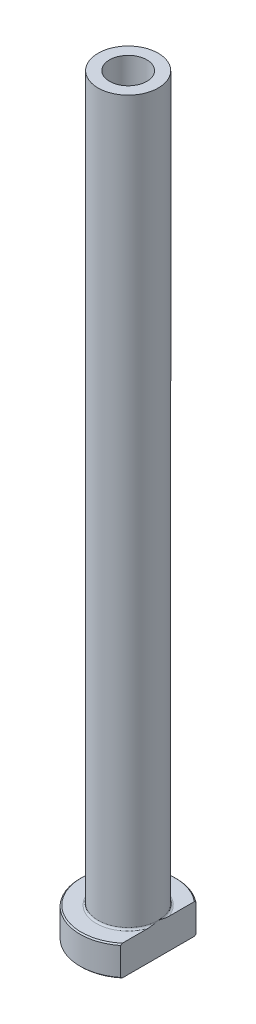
ISO-10303-21;
HEADER;
FILE_DESCRIPTION(('STEP AP214'),'2;1');
FILE_NAME('part.step','',(''),(''),'','','');
FILE_SCHEMA(('AUTOMOTIVE_DESIGN { 1 0 10303 214 1 1 1 1 }'));
ENDSEC;
DATA;
#1=APPLICATION_CONTEXT('core data for automotive mechanical design processes');
#2=APPLICATION_PROTOCOL_DEFINITION('international standard','automotive_design',2000,#1);
#3=PRODUCT_CONTEXT('',#1,'mechanical');
#4=PRODUCT('Part','Part','',(#3));
#5=PRODUCT_RELATED_PRODUCT_CATEGORY('part','',(#4));
#6=PRODUCT_DEFINITION_FORMATION('','',#4);
#7=PRODUCT_DEFINITION_CONTEXT('part definition',#1,'design');
#8=PRODUCT_DEFINITION('design','',#6,#7);
#9=PRODUCT_DEFINITION_SHAPE('','',#8);
#10=(LENGTH_UNIT() NAMED_UNIT(*) SI_UNIT(.MILLI.,.METRE.));
#11=(NAMED_UNIT(*) PLANE_ANGLE_UNIT() SI_UNIT($,.RADIAN.));
#12=(NAMED_UNIT(*) SI_UNIT($,.STERADIAN.) SOLID_ANGLE_UNIT());
#13=UNCERTAINTY_MEASURE_WITH_UNIT(LENGTH_MEASURE(1.E-05),#10,'distance_accuracy_value','');
#14=(GEOMETRIC_REPRESENTATION_CONTEXT(3) GLOBAL_UNCERTAINTY_ASSIGNED_CONTEXT((#13)) GLOBAL_UNIT_ASSIGNED_CONTEXT((#10,
#11,#12)) REPRESENTATION_CONTEXT('',''));
#15=CARTESIAN_POINT('',(0.,0.,0.));
#16=DIRECTION('',(0.,0.,1.));
#17=DIRECTION('',(1.,0.,0.));
#18=AXIS2_PLACEMENT_3D('',#15,#16,#17);
#19=CARTESIAN_POINT('',(0.,92.1876809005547,0.));
#20=DIRECTION('',(0.,1.,0.));
#21=DIRECTION('',(0.,0.,1.));
#22=AXIS2_PLACEMENT_3D('',#19,#20,#21);
#23=CYLINDRICAL_SURFACE('',#22,3.1);
#24=CARTESIAN_POINT('',(0.,125.,0.));
#25=DIRECTION('',(0.,1.,0.));
#26=DIRECTION('',(0.,0.,1.));
#27=AXIS2_PLACEMENT_3D('',#24,#25,#26);
#28=CIRCLE('',#27,3.1);
#29=CARTESIAN_POINT('',(0.,125.,3.1));
#30=VERTEX_POINT('',#29);
#31=EDGE_CURVE('E167',#30,#30,#28,.T.);
#32=ORIENTED_EDGE('',*,*,#31,.T.);
#33=EDGE_LOOP('',(#32));
#34=FACE_BOUND('',#33,.T.);
#35=CARTESIAN_POINT('',(0.,80.,0.));
#36=DIRECTION('',(0.,1.,0.));
#37=DIRECTION('',(0.,0.,1.));
#38=AXIS2_PLACEMENT_3D('',#35,#36,#37);
#39=CIRCLE('',#38,3.1);
#40=CARTESIAN_POINT('',(0.,80.,3.1));
#41=VERTEX_POINT('',#40);
#42=EDGE_CURVE('E170',#41,#41,#39,.T.);
#43=ORIENTED_EDGE('',*,*,#42,.F.);
#44=EDGE_LOOP('',(#43));
#45=FACE_BOUND('',#44,.T.);
#46=ADVANCED_FACE('F32',(#34,#45),#23,.F.);
#47=CARTESIAN_POINT('',(-3.1,125.,0.));
#48=DIRECTION('',(0.,1.,0.));
#49=DIRECTION('',(0.,0.,1.));
#50=AXIS2_PLACEMENT_3D('',#47,#48,#49);
#51=PLANE('',#50);
#52=CARTESIAN_POINT('',(0.,125.,0.));
#53=DIRECTION('',(0.,1.,0.));
#54=DIRECTION('',(0.,0.,1.));
#55=AXIS2_PLACEMENT_3D('',#52,#53,#54);
#56=CIRCLE('',#55,5.);
#57=CARTESIAN_POINT('',(0.,125.,5.));
#58=VERTEX_POINT('',#57);
#59=EDGE_CURVE('E174',#58,#58,#56,.T.);
#60=ORIENTED_EDGE('',*,*,#59,.T.);
#61=EDGE_LOOP('',(#60));
#62=FACE_BOUND('',#61,.T.);
#63=ORIENTED_EDGE('',*,*,#31,.F.);
#64=EDGE_LOOP('',(#63));
#65=FACE_BOUND('',#64,.T.);
#66=ADVANCED_FACE('F157',(#62,#65),#51,.T.);
#67=CARTESIAN_POINT('',(0.,92.1876809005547,0.));
#68=DIRECTION('',(0.,1.,0.));
#69=DIRECTION('',(0.,0.,1.));
#70=AXIS2_PLACEMENT_3D('',#67,#68,#69);
#71=CYLINDRICAL_SURFACE('',#70,5.);
#72=CARTESIAN_POINT('',(0.,5.3,0.));
#73=DIRECTION('',(0.,1.,0.));
#74=DIRECTION('',(0.,0.,1.));
#75=AXIS2_PLACEMENT_3D('',#72,#73,#74);
#76=CIRCLE('',#75,5.);
#77=CARTESIAN_POINT('',(5.,5.3,0.));
#78=VERTEX_POINT('',#77);
#79=EDGE_CURVE('E180',#78,#78,#76,.T.);
#80=ORIENTED_EDGE('',*,*,#79,.T.);
#81=EDGE_LOOP('',(#80));
#82=FACE_BOUND('',#81,.T.);
#83=ORIENTED_EDGE('',*,*,#59,.F.);
#84=EDGE_LOOP('',(#83));
#85=FACE_BOUND('',#84,.T.);
#86=ADVANCED_FACE('F162',(#82,#85),#71,.T.);
#87=CARTESIAN_POINT('',(-4.99999999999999,5.,0.));
#88=DIRECTION('',(0.,1.,0.));
#89=DIRECTION('',(0.,0.,1.));
#90=AXIS2_PLACEMENT_3D('',#87,#88,#89);
#91=PLANE('',#90);
#92=DIRECTION('',(0.,0.,1.));
#93=VECTOR('',#92,1.);
#94=CARTESIAN_POINT('',(5.,5.,0.));
#95=LINE('',#94,#93);
#96=CARTESIAN_POINT('',(5.,5.,-5.9866518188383));
#97=VERTEX_POINT('',#96);
#98=CARTESIAN_POINT('',(5.,5.,-1.7578395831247));
#99=VERTEX_POINT('',#98);
#100=EDGE_CURVE('E54',#97,#99,#95,.T.);
#101=ORIENTED_EDGE('',*,*,#100,.F.);
#102=CARTESIAN_POINT('',(0.,5.,0.));
#103=DIRECTION('',(0.,1.,0.));
#104=DIRECTION('',(0.,0.,1.));
#105=AXIS2_PLACEMENT_3D('',#102,#103,#104);
#106=CIRCLE('',#105,7.79999999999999);
#107=CARTESIAN_POINT('',(4.99999999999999,5.,5.9866518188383));
#108=VERTEX_POINT('',#107);
#109=EDGE_CURVE('E186',#97,#108,#106,.T.);
#110=ORIENTED_EDGE('',*,*,#109,.T.);
#111=CARTESIAN_POINT('',(5.,5.,1.7578395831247));
#112=VERTEX_POINT('',#111);
#113=EDGE_CURVE('E134',#112,#108,#95,.T.);
#114=ORIENTED_EDGE('',*,*,#113,.F.);
#115=CARTESIAN_POINT('',(0.,5.,0.));
#116=DIRECTION('',(0.,1.,0.));
#117=DIRECTION('',(0.,0.,1.));
#118=AXIS2_PLACEMENT_3D('',#115,#116,#117);
#119=CIRCLE('',#118,5.3);
#120=EDGE_CURVE('E183',#112,#99,#119,.F.);
#121=ORIENTED_EDGE('',*,*,#120,.T.);
#122=EDGE_LOOP('',(#101,#110,#114,#121));
#123=FACE_BOUND('',#122,.T.);
#124=ADVANCED_FACE('F197',(#123),#91,.T.);
#125=CARTESIAN_POINT('',(0.,92.1876809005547,0.));
#126=DIRECTION('',(0.,1.,0.));
#127=DIRECTION('',(0.,0.,1.));
#128=AXIS2_PLACEMENT_3D('',#125,#126,#127);
#129=CYLINDRICAL_SURFACE('',#128,7.99999999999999);
#130=DIRECTION('',(0.,-1.,0.));
#131=VECTOR('',#130,1.);
#132=CARTESIAN_POINT('',(4.99999999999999,125.,6.24499799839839));
#133=LINE('',#132,#131);
#134=CARTESIAN_POINT('',(4.99999999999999,4.8,6.24499799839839));
#135=VERTEX_POINT('',#134);
#136=CARTESIAN_POINT('',(4.99999999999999,0.20000000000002,6.24499799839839));
#137=VERTEX_POINT('',#136);
#138=EDGE_CURVE('E82',#135,#137,#133,.T.);
#139=ORIENTED_EDGE('',*,*,#138,.F.);
#140=CARTESIAN_POINT('',(0.,4.8,0.));
#141=DIRECTION('',(0.,1.,0.));
#142=DIRECTION('',(0.,0.,1.));
#143=AXIS2_PLACEMENT_3D('',#140,#141,#142);
#144=CIRCLE('',#143,7.99999999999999);
#145=CARTESIAN_POINT('',(5.,4.8,-6.24499799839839));
#146=VERTEX_POINT('',#145);
#147=EDGE_CURVE('E95',#135,#146,#144,.F.);
#148=ORIENTED_EDGE('',*,*,#147,.T.);
#149=DIRECTION('',(0.,-1.,0.));
#150=VECTOR('',#149,1.);
#151=CARTESIAN_POINT('',(5.,125.,-6.24499799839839));
#152=LINE('',#151,#150);
#153=CARTESIAN_POINT('',(5.,0.20000000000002,-6.24499799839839));
#154=VERTEX_POINT('',#153);
#155=EDGE_CURVE('E192',#146,#154,#152,.T.);
#156=ORIENTED_EDGE('',*,*,#155,.T.);
#157=CARTESIAN_POINT('',(0.,0.20000000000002,0.));
#158=DIRECTION('',(0.,-1.,0.));
#159=DIRECTION('',(0.,0.,-1.));
#160=AXIS2_PLACEMENT_3D('',#157,#158,#159);
#161=CIRCLE('',#160,7.99999999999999);
#162=EDGE_CURVE('E98',#154,#137,#161,.F.);
#163=ORIENTED_EDGE('',*,*,#162,.T.);
#164=EDGE_LOOP('',(#139,#148,#156,#163));
#165=FACE_BOUND('',#164,.T.);
#166=ADVANCED_FACE('F190',(#165),#129,.T.);
#167=CARTESIAN_POINT('',(-7.99999999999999,0.,0.));
#168=DIRECTION('',(0.,-1.,0.));
#169=DIRECTION('',(0.,0.,-1.));
#170=AXIS2_PLACEMENT_3D('',#167,#168,#169);
#171=PLANE('',#170);
#172=CARTESIAN_POINT('',(0.,0.,0.));
#173=DIRECTION('',(0.,-1.,0.));
#174=DIRECTION('',(0.,0.,-1.));
#175=AXIS2_PLACEMENT_3D('',#172,#173,#174);
#176=CIRCLE('',#175,3.84999999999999);
#177=CARTESIAN_POINT('',(0.,0.,-3.84999999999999));
#178=VERTEX_POINT('',#177);
#179=EDGE_CURVE('E40',#178,#178,#176,.F.);
#180=ORIENTED_EDGE('',*,*,#179,.T.);
#181=EDGE_LOOP('',(#180));
#182=FACE_BOUND('',#181,.T.);
#183=DIRECTION('',(0.,0.,-1.));
#184=VECTOR('',#183,1.);
#185=CARTESIAN_POINT('',(4.99999999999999,0.,6.24499799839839));
#186=LINE('',#185,#184);
#187=CARTESIAN_POINT('',(4.99999999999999,0.,5.98665181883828));
#188=VERTEX_POINT('',#187);
#189=CARTESIAN_POINT('',(5.,0.,-5.98665181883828));
#190=VERTEX_POINT('',#189);
#191=EDGE_CURVE('E47',#188,#190,#186,.T.);
#192=ORIENTED_EDGE('',*,*,#191,.F.);
#193=CARTESIAN_POINT('',(0.,0.,0.));
#194=DIRECTION('',(0.,-1.,0.));
#195=DIRECTION('',(0.,0.,-1.));
#196=AXIS2_PLACEMENT_3D('',#193,#194,#195);
#197=CIRCLE('',#196,7.79999999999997);
#198=EDGE_CURVE('E92',#188,#190,#197,.T.);
#199=ORIENTED_EDGE('',*,*,#198,.T.);
#200=EDGE_LOOP('',(#192,#199));
#201=FACE_BOUND('',#200,.T.);
#202=ADVANCED_FACE('F91',(#182,#201),#171,.T.);
#203=CARTESIAN_POINT('',(0.,92.1876809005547,0.));
#204=DIRECTION('',(0.,1.,0.));
#205=DIRECTION('',(0.,0.,1.));
#206=AXIS2_PLACEMENT_3D('',#203,#204,#205);
#207=CYLINDRICAL_SURFACE('',#206,3.34999999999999);
#208=CARTESIAN_POINT('',(0.,0.500000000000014,0.));
#209=DIRECTION('',(0.,-1.,0.));
#210=DIRECTION('',(0.,0.,-1.));
#211=AXIS2_PLACEMENT_3D('',#208,#209,#210);
#212=CIRCLE('',#211,3.34999999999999);
#213=CARTESIAN_POINT('',(0.,0.500000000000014,-3.34999999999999));
#214=VERTEX_POINT('',#213);
#215=EDGE_CURVE('E11',#214,#214,#212,.T.);
#216=ORIENTED_EDGE('',*,*,#215,.T.);
#217=EDGE_LOOP('',(#216));
#218=FACE_BOUND('',#217,.T.);
#219=CARTESIAN_POINT('',(0.,68.,0.));
#220=DIRECTION('',(0.,1.,0.));
#221=DIRECTION('',(0.,0.,1.));
#222=AXIS2_PLACEMENT_3D('',#219,#220,#221);
#223=CIRCLE('',#222,3.35);
#224=CARTESIAN_POINT('',(0.,68.,3.35));
#225=VERTEX_POINT('',#224);
#226=EDGE_CURVE('E172',#225,#225,#223,.T.);
#227=ORIENTED_EDGE('',*,*,#226,.T.);
#228=EDGE_LOOP('',(#227));
#229=FACE_BOUND('',#228,.T.);
#230=ADVANCED_FACE('F215',(#218,#229),#207,.F.);
#231=CARTESIAN_POINT('',(0.,68.,0.));
#232=DIRECTION('',(0.,-1.,0.));
#233=DIRECTION('',(0.,0.,-1.));
#234=AXIS2_PLACEMENT_3D('',#231,#232,#233);
#235=CONICAL_SURFACE('',#234,3.35,0.0208303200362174);
#236=ORIENTED_EDGE('',*,*,#42,.T.);
#237=EDGE_LOOP('',(#236));
#238=FACE_BOUND('',#237,.T.);
#239=ORIENTED_EDGE('',*,*,#226,.F.);
#240=EDGE_LOOP('',(#239));
#241=FACE_BOUND('',#240,.T.);
#242=ADVANCED_FACE('F111',(#238,#241),#235,.F.);
#243=CARTESIAN_POINT('',(0.,5.3,0.));
#244=DIRECTION('',(0.,1.,0.));
#245=DIRECTION('',(0.,0.,1.));
#246=AXIS2_PLACEMENT_3D('',#243,#244,#245);
#247=TOROIDAL_SURFACE('',#246,5.3,0.3);
#248=ORIENTED_EDGE('',*,*,#120,.F.);
#249=CARTESIAN_POINT('',(5.,5.3,0.));
#250=CARTESIAN_POINT('',(5.,5.30000062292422,-1.31469087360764E-10));
#251=CARTESIAN_POINT('',(5.,5.30000124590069,2.52759255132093E-07));
#252=CARTESIAN_POINT('',(5.,5.30000240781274,9.47164419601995E-07));
#253=CARTESIAN_POINT('',(5.,5.30000293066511,1.40594046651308E-06));
#254=CARTESIAN_POINT('',(5.,5.30000402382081,2.50637618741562E-06));
#255=CARTESIAN_POINT('',(5.,5.30000457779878,3.16588923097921E-06));
#256=CARTESIAN_POINT('',(5.,5.3000055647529,4.52859982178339E-06));
#257=CARTESIAN_POINT('',(5.,5.30000600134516,5.22939463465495E-06));
#258=CARTESIAN_POINT('',(5.,5.30000763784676,7.96122010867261E-06));
#259=CARTESIAN_POINT('',(5.,5.30000875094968,1.00477412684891E-05));
#260=CARTESIAN_POINT('',(5.,5.30001056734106,1.41660877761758E-05));
#261=CARTESIAN_POINT('',(5.,5.30001129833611,1.61861787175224E-05));
#262=CARTESIAN_POINT('',(5.,5.30001439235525,2.47865746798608E-05));
#263=CARTESIAN_POINT('',(5.,5.30001672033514,3.13830291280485E-05));
#264=CARTESIAN_POINT('',(5.,5.30002012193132,4.38084229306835E-05));
#265=CARTESIAN_POINT('',(5.,5.3000213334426,4.95992746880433E-05));
#266=CARTESIAN_POINT('',(5.,5.30003020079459,9.27862626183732E-05));
#267=CARTESIAN_POINT('',(5.,5.30003696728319,0.00013030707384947));
#268=CARTESIAN_POINT('',(5.,5.30006659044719,0.000278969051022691));
#269=CARTESIAN_POINT('',(5.,5.30009481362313,0.000389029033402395));
#270=CARTESIAN_POINT('',(5.,5.30020506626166,0.000826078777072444));
#271=CARTESIAN_POINT('',(5.,5.30028365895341,0.00115365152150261));
#272=CARTESIAN_POINT('',(5.,5.30059919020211,0.00245925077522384));
#273=CARTESIAN_POINT('',(5.,5.30084048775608,0.00343651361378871));
#274=CARTESIAN_POINT('',(5.,5.30184626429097,0.00752058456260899));
#275=CARTESIAN_POINT('',(5.,5.30260525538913,0.0106283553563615));
#276=CARTESIAN_POINT('',(5.,5.3099646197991,0.0407482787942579));
#277=CARTESIAN_POINT('',(5.,5.31658985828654,0.0677561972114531));
#278=CARTESIAN_POINT('',(5.,5.32953319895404,0.120688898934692));
#279=CARTESIAN_POINT('',(5.,5.33585289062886,0.146613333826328));
#280=CARTESIAN_POINT('',(5.,5.34926050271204,0.20179565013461));
#281=CARTESIAN_POINT('',(5.,5.35634306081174,0.23105486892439));
#282=CARTESIAN_POINT('',(5.,5.37050252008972,0.289917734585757));
#283=CARTESIAN_POINT('',(5.,5.37757848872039,0.319521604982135));
#284=CARTESIAN_POINT('',(5.,5.39452602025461,0.391032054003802));
#285=CARTESIAN_POINT('',(5.,5.40434071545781,0.432952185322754));
#286=CARTESIAN_POINT('',(5.,5.42340141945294,0.515763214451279));
#287=CARTESIAN_POINT('',(5.,5.43265559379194,0.556652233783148));
#288=CARTESIAN_POINT('',(5.,5.45710553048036,0.667075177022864));
#289=CARTESIAN_POINT('',(5.,5.47194176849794,0.736689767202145));
#290=CARTESIAN_POINT('',(5.,5.5001822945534,0.876836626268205));
#291=CARTESIAN_POINT('',(5.,5.51357312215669,0.947371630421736));
#292=CARTESIAN_POINT('',(5.,5.53930921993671,1.09497328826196));
#293=CARTESIAN_POINT('',(5.,5.55146217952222,1.17207432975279));
#294=CARTESIAN_POINT('',(5.,5.57239669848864,1.32672649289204));
#295=CARTESIAN_POINT('',(5.,5.58117877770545,1.40427754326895));
#296=CARTESIAN_POINT('',(5.,5.59499725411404,1.5687382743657));
#297=CARTESIAN_POINT('',(5.,5.59948802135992,1.65570044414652));
#298=CARTESIAN_POINT('',(5.,5.60018885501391,1.7853530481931));
#299=CARTESIAN_POINT('',(5.,5.5994521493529,1.82802575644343));
#300=CARTESIAN_POINT('',(5.,5.59559364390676,1.91325081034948));
#301=CARTESIAN_POINT('',(5.,5.59247319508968,1.95580321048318));
#302=CARTESIAN_POINT('',(5.,5.58383242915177,2.03512365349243));
#303=CARTESIAN_POINT('',(5.,5.57867386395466,2.07192937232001));
#304=CARTESIAN_POINT('',(5.,5.56543793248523,2.14526756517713));
#305=CARTESIAN_POINT('',(5.,5.55734203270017,2.18179676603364));
#306=CARTESIAN_POINT('',(5.,5.53718005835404,2.25427226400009));
#307=CARTESIAN_POINT('',(5.,5.5250705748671,2.29020746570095));
#308=CARTESIAN_POINT('',(5.,5.50270928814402,2.34223029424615));
#309=CARTESIAN_POINT('',(5.,5.49457811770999,2.35922314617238));
#310=CARTESIAN_POINT('',(5.,5.47657809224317,2.39224900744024));
#311=CARTESIAN_POINT('',(5.,5.46671281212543,2.40828390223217));
#312=CARTESIAN_POINT('',(5.,5.44695893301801,2.43579467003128));
#313=CARTESIAN_POINT('',(5.,5.43745879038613,2.4475459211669));
#314=CARTESIAN_POINT('',(5.,5.41677914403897,2.4694647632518));
#315=CARTESIAN_POINT('',(5.,5.40560543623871,2.47963758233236));
#316=CARTESIAN_POINT('',(5.,5.38617750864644,2.49393642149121));
#317=CARTESIAN_POINT('',(5.,5.37851643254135,2.49886271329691));
#318=CARTESIAN_POINT('',(5.,5.36252740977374,2.50749953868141));
#319=CARTESIAN_POINT('',(5.,5.35419984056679,2.51121075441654));
#320=CARTESIAN_POINT('',(5.,5.33690648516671,2.51712941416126));
#321=CARTESIAN_POINT('',(5.,5.32793451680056,2.51931927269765));
#322=CARTESIAN_POINT('',(5.,5.30973576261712,2.52185978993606));
#323=CARTESIAN_POINT('',(5.,5.30050931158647,2.52221275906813));
#324=CARTESIAN_POINT('',(5.,5.28349166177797,2.52112455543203));
#325=CARTESIAN_POINT('',(5.,5.27568322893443,2.51993178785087));
#326=CARTESIAN_POINT('',(5.,5.26036860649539,2.5162829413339));
#327=CARTESIAN_POINT('',(5.,5.25286261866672,2.51382603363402));
#328=CARTESIAN_POINT('',(5.,5.23590266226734,2.50685484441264));
#329=CARTESIAN_POINT('',(5.,5.22661875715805,2.501929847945));
#330=CARTESIAN_POINT('',(5.,5.20895514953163,2.49066548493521));
#331=CARTESIAN_POINT('',(5.,5.20057756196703,2.48432291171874));
#332=CARTESIAN_POINT('',(5.,5.17987008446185,2.46645212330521));
#333=CARTESIAN_POINT('',(5.,5.16824151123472,2.45411867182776));
#334=CARTESIAN_POINT('',(5.,5.1469246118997,2.42790849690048));
#335=CARTESIAN_POINT('',(5.,5.1372398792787,2.4140289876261));
#336=CARTESIAN_POINT('',(5.,5.11080706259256,2.37143175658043));
#337=CARTESIAN_POINT('',(5.,5.0962877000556,2.34134703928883));
#338=CARTESIAN_POINT('',(5.,5.07130349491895,2.27940731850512));
#339=CARTESIAN_POINT('',(5.,5.0608711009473,2.24754035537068));
#340=CARTESIAN_POINT('',(5.,5.03890359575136,2.1678724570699));
#341=CARTESIAN_POINT('',(5.,5.02913523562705,2.1195906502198));
#342=CARTESIAN_POINT('',(5.,5.01416953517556,2.02224928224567));
#343=CARTESIAN_POINT('',(5.,5.00898637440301,1.97318778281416));
#344=CARTESIAN_POINT('',(5.,5.00220823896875,1.87635767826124));
#345=CARTESIAN_POINT('',(5.,5.00050709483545,1.82859609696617));
#346=CARTESIAN_POINT('',(5.,4.99969104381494,1.73330165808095));
#347=CARTESIAN_POINT('',(5.,5.00056327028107,1.68576884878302));
#348=CARTESIAN_POINT('',(5.,5.00484296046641,1.57937770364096));
#349=CARTESIAN_POINT('',(5.,5.00880932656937,1.5205428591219));
#350=CARTESIAN_POINT('',(5.,5.0192596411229,1.40312974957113));
#351=CARTESIAN_POINT('',(5.,5.02574264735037,1.34455139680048));
#352=CARTESIAN_POINT('',(5.,5.04090087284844,1.22627662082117));
#353=CARTESIAN_POINT('',(5.,5.04962425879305,1.16658647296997));
#354=CARTESIAN_POINT('',(5.,5.06877923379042,1.0473246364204));
#355=CARTESIAN_POINT('',(5.,5.07921523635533,0.987753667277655));
#356=CARTESIAN_POINT('',(5.,5.10551698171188,0.846936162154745));
#357=CARTESIAN_POINT('',(5.,5.12196565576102,0.765799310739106));
#358=CARTESIAN_POINT('',(5.,5.15639716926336,0.604819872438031));
#359=CARTESIAN_POINT('',(5.,5.17436050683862,0.524973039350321));
#360=CARTESIAN_POINT('',(5.,5.20921667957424,0.374726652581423));
#361=CARTESIAN_POINT('',(4.99999999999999,5.22599388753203,0.304300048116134));
#362=CARTESIAN_POINT('',(5.,5.2519110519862,0.196907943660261));
#363=CARTESIAN_POINT('',(5.,5.26090146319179,0.159905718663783));
#364=CARTESIAN_POINT('',(4.99999999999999,5.27881854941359,0.0865164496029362));
#365=CARTESIAN_POINT('',(4.99999999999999,5.28774391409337,0.0501291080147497));
#366=CARTESIAN_POINT('',(5.,5.29739627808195,0.0106218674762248));
#367=CARTESIAN_POINT('',(5.,5.2981568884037,0.0075076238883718));
#368=CARTESIAN_POINT('',(5.,5.29916304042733,0.00342209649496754));
#369=CARTESIAN_POINT('',(4.99999999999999,5.29940309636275,0.00244985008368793));
#370=CARTESIAN_POINT('',(5.,5.29971711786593,0.00115049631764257));
#371=CARTESIAN_POINT('',(5.,5.29979541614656,0.000824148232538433));
#372=CARTESIAN_POINT('',(5.,5.29990531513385,0.000388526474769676));
#373=CARTESIAN_POINT('',(5.,5.29993348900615,0.000278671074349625));
#374=CARTESIAN_POINT('',(5.,5.29996306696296,0.000130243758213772));
#375=CARTESIAN_POINT('',(5.,5.29996982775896,9.27511390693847E-05));
#376=CARTESIAN_POINT('',(5.,5.29997868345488,4.9592989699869E-05));
#377=CARTESIAN_POINT('',(5.,5.29997989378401,4.38036564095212E-05));
#378=CARTESIAN_POINT('',(5.,5.29998329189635,3.138141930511E-05));
#379=CARTESIAN_POINT('',(5.,5.29998561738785,2.4786522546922E-05));
#380=CARTESIAN_POINT('',(5.,5.29998870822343,1.61877550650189E-05));
#381=CARTESIAN_POINT('',(5.,5.29998943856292,1.4167777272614E-05));
#382=CARTESIAN_POINT('',(5.,5.2999912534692,1.00495534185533E-05));
#383=CARTESIAN_POINT('',(5.,5.2999923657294,7.96302685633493E-06));
#384=CARTESIAN_POINT('',(5.,5.29999400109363,5.23107434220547E-06));
#385=CARTESIAN_POINT('',(5.,5.29999443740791,4.5302105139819E-06));
#386=CARTESIAN_POINT('',(5.,5.29999542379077,3.16731170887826E-06));
#387=CARTESIAN_POINT('',(5.,5.299995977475,2.50767739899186E-06));
#388=CARTESIAN_POINT('',(5.,5.2999970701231,1.40695888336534E-06));
#389=CARTESIAN_POINT('',(5.,5.29999759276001,9.48032525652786E-07));
#390=CARTESIAN_POINT('',(5.,5.29999875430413,2.53244363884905E-07));
#391=CARTESIAN_POINT('',(5.,5.29999937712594,1.31459889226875E-10));
#392=CARTESIAN_POINT('',(5.,5.3,0.));
#393=B_SPLINE_CURVE_WITH_KNOTS('',3,(#249,#250,#251,#252,#253,#254,#255,#256,#257,#258,#259,
#260,#261,#262,#263,#264,#265,#266,#267,#268,#269,#270,#271,#272,#273,#274,#275,#276,#277,#278,
#279,#280,#281,#282,#283,#284,#285,#286,#287,#288,#289,#290,#291,#292,#293,#294,#295,#296,#297,
#298,#299,#300,#301,#302,#303,#304,#305,#306,#307,#308,#309,#310,#311,#312,#313,#314,#315,#316,
#317,#318,#319,#320,#321,#322,#323,#324,#325,#326,#327,#328,#329,#330,#331,#332,#333,#334,#335,
#336,#337,#338,#339,#340,#341,#342,#343,#344,#345,#346,#347,#348,#349,#350,#351,#352,#353,#354,
#355,#356,#357,#358,#359,#360,#361,#362,#363,#364,#365,#366,#367,#368,#369,#370,#371,#372,#373,
#374,#375,#376,#377,#378,#379,#380,#381,#382,#383,#384,#385,#386,#387,#388,#389,#390,#391,#392),
.UNSPECIFIED.,.T.,.F.,(4,2,2,2,2,2,2,2,2,2,2,2,2,2,2,2,2,2,2,2,2,2,2,2,2,2,2,2,2,2,2,2,2,2,2,2,
2,2,2,2,2,2,2,2,2,2,2,2,2,2,2,2,2,2,2,2,2,2,2,2,2,2,2,2,2,2,2,2,2,2,2,4),(0.,
1.88939263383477E-06,3.98058820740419E-06,6.54818442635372E-06,9.02404238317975E-06,
1.60938732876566E-05,2.25328176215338E-05,4.34843900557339E-05,6.12120172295E-05,
0.000175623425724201,0.000516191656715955,0.00152710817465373,0.00454656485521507,
0.0141443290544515,0.0975679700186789,0.177619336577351,0.267931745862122,0.35924502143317,
0.488405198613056,0.614173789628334,0.827694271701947,1.04305715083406,1.27715608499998,
1.51121890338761,1.77214751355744,1.90013509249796,2.02805018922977,2.13945459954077,
2.25157451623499,2.36494894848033,2.42139235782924,2.47772074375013,2.52293802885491,
2.56800219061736,2.59524342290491,2.62246933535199,2.65000494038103,2.67750590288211,
2.70108948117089,2.72468854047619,2.7560397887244,2.78746268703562,2.838028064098,
2.88868607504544,2.98834295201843,3.08877575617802,3.23618650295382,3.38405153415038,
3.52733651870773,3.66990630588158,3.84673903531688,4.02350562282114,4.20444776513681,
4.38586374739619,4.63419556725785,4.87971270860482,5.09690175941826,5.21113882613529,
5.32353360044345,5.33315137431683,5.33615533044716,5.33716246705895,5.33750240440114,
5.33761672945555,5.33763445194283,5.3376553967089,5.33766183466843,5.33766890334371,
5.33767137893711,5.33767394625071,5.33767603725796,5.33767792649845),.UNSPECIFIED.);
#394=EDGE_CURVE('E126',#112,#78,#393,.T.);
#395=ORIENTED_EDGE('',*,*,#394,.T.);
#396=ORIENTED_EDGE('',*,*,#79,.F.);
#397=CARTESIAN_POINT('',(5.,5.3,0.));
#398=CARTESIAN_POINT('',(5.,5.29999937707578,1.31470461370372E-10));
#399=CARTESIAN_POINT('',(5.,5.29999875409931,-2.52759253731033E-07));
#400=CARTESIAN_POINT('',(5.,5.29999759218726,-9.47164418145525E-07));
#401=CARTESIAN_POINT('',(5.,5.29999706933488,-1.40594046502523E-06));
#402=CARTESIAN_POINT('',(5.,5.29999597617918,-2.50637618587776E-06));
#403=CARTESIAN_POINT('',(5.,5.29999542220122,-3.16588922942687E-06));
#404=CARTESIAN_POINT('',(5.,5.2999944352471,-4.52859982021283E-06));
#405=CARTESIAN_POINT('',(5.,5.29999399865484,-5.22939463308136E-06));
#406=CARTESIAN_POINT('',(5.,5.29999236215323,-7.96122010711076E-06));
#407=CARTESIAN_POINT('',(5.,5.29999124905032,-1.00477412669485E-05));
#408=CARTESIAN_POINT('',(5.,5.29998943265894,-1.41660877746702E-05));
#409=CARTESIAN_POINT('',(5.,5.29998870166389,-1.61861787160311E-05));
#410=CARTESIAN_POINT('',(5.,5.29998560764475,-2.47865746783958E-05));
#411=CARTESIAN_POINT('',(5.,5.29998327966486,-3.13830291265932E-05));
#412=CARTESIAN_POINT('',(5.,5.29997987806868,-4.38084229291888E-05));
#413=CARTESIAN_POINT('',(5.,5.2999786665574,-4.95992746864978E-05));
#414=CARTESIAN_POINT('',(5.,5.29996979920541,-9.27862626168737E-05));
#415=CARTESIAN_POINT('',(5.,5.2999630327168,-0.000130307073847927));
#416=CARTESIAN_POINT('',(5.,5.2999334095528,-0.000278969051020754));
#417=CARTESIAN_POINT('',(5.,5.29990518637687,-0.000389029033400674));
#418=CARTESIAN_POINT('',(5.,5.29979493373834,-0.000826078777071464));
#419=CARTESIAN_POINT('',(5.,5.29971634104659,-0.00115365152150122));
#420=CARTESIAN_POINT('',(5.,5.29940080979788,-0.00245925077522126));
#421=CARTESIAN_POINT('',(5.,5.29915951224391,-0.00343651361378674));
#422=CARTESIAN_POINT('',(5.,5.29815373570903,-0.00752058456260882));
#423=CARTESIAN_POINT('',(5.,5.29739474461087,-0.0106283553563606));
#424=CARTESIAN_POINT('',(5.,5.29003538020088,-0.0407482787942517));
#425=CARTESIAN_POINT('',(5.,5.28341014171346,-0.0677561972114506));
#426=CARTESIAN_POINT('',(5.,5.27046680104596,-0.120688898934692));
#427=CARTESIAN_POINT('',(5.,5.26414710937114,-0.146613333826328));
#428=CARTESIAN_POINT('',(5.,5.25073949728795,-0.201795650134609));
#429=CARTESIAN_POINT('',(5.,5.24365693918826,-0.231054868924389));
#430=CARTESIAN_POINT('',(5.,5.22949747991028,-0.289917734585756));
#431=CARTESIAN_POINT('',(5.,5.22242151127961,-0.319521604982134));
#432=CARTESIAN_POINT('',(5.,5.20547397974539,-0.391032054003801));
#433=CARTESIAN_POINT('',(5.,5.19565928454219,-0.432952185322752));
#434=CARTESIAN_POINT('',(5.,5.17659858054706,-0.515763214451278));
#435=CARTESIAN_POINT('',(5.,5.16734440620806,-0.556652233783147));
#436=CARTESIAN_POINT('',(5.,5.14289446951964,-0.667075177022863));
#437=CARTESIAN_POINT('',(5.,5.12805823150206,-0.736689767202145));
#438=CARTESIAN_POINT('',(5.,5.0998177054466,-0.876836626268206));
#439=CARTESIAN_POINT('',(5.,5.08642687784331,-0.947371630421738));
#440=CARTESIAN_POINT('',(5.,5.06069078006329,-1.09497328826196));
#441=CARTESIAN_POINT('',(5.,5.04853782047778,-1.17207432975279));
#442=CARTESIAN_POINT('',(5.,5.02760330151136,-1.32672649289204));
#443=CARTESIAN_POINT('',(5.,5.01882122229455,-1.40427754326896));
#444=CARTESIAN_POINT('',(5.,5.00500274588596,-1.5687382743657));
#445=CARTESIAN_POINT('',(5.,5.00051197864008,-1.65570044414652));
#446=CARTESIAN_POINT('',(5.,4.99981114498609,-1.78535304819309));
#447=CARTESIAN_POINT('',(5.,5.0005478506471,-1.82802575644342));
#448=CARTESIAN_POINT('',(5.,5.00440635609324,-1.91325081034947));
#449=CARTESIAN_POINT('',(5.,5.00752680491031,-1.95580321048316));
#450=CARTESIAN_POINT('',(5.,5.01616757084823,-2.03512365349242));
#451=CARTESIAN_POINT('',(5.,5.02132613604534,-2.07192937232));
#452=CARTESIAN_POINT('',(5.,5.03456206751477,-2.14526756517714));
#453=CARTESIAN_POINT('',(5.,5.04265796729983,-2.18179676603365));
#454=CARTESIAN_POINT('',(5.,5.06281994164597,-2.25427226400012));
#455=CARTESIAN_POINT('',(5.,5.07492942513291,-2.29020746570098));
#456=CARTESIAN_POINT('',(5.,5.097290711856,-2.34223029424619));
#457=CARTESIAN_POINT('',(5.,5.10542188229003,-2.35922314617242));
#458=CARTESIAN_POINT('',(5.,5.12342190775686,-2.39224900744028));
#459=CARTESIAN_POINT('',(5.,5.1332871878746,-2.40828390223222));
#460=CARTESIAN_POINT('',(5.,5.15304106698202,-2.43579467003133));
#461=CARTESIAN_POINT('',(5.,5.16254120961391,-2.44754592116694));
#462=CARTESIAN_POINT('',(5.,5.18322085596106,-2.46946476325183));
#463=CARTESIAN_POINT('',(5.,5.19439456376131,-2.47963758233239));
#464=CARTESIAN_POINT('',(5.,5.21382249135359,-2.49393642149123));
#465=CARTESIAN_POINT('',(5.,5.22148356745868,-2.49886271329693));
#466=CARTESIAN_POINT('',(5.,5.23747259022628,-2.50749953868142));
#467=CARTESIAN_POINT('',(5.,5.24580015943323,-2.51121075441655));
#468=CARTESIAN_POINT('',(5.,5.26309351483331,-2.51712941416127));
#469=CARTESIAN_POINT('',(5.,5.27206548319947,-2.51931927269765));
#470=CARTESIAN_POINT('',(5.,5.2902642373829,-2.52185978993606));
#471=CARTESIAN_POINT('',(5.,5.29949068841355,-2.52221275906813));
#472=CARTESIAN_POINT('',(5.,5.31650833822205,-2.52112455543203));
#473=CARTESIAN_POINT('',(5.,5.32431677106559,-2.51993178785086));
#474=CARTESIAN_POINT('',(5.,5.33963139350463,-2.5162829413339));
#475=CARTESIAN_POINT('',(5.,5.3471373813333,-2.51382603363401));
#476=CARTESIAN_POINT('',(5.,5.36409733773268,-2.50685484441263));
#477=CARTESIAN_POINT('',(5.,5.37338124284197,-2.50192984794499));
#478=CARTESIAN_POINT('',(5.,5.39104485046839,-2.49066548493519));
#479=CARTESIAN_POINT('',(5.,5.39942243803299,-2.48432291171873));
#480=CARTESIAN_POINT('',(5.,5.42012991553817,-2.46645212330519));
#481=CARTESIAN_POINT('',(5.,5.4317584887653,-2.45411867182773));
#482=CARTESIAN_POINT('',(5.,5.45307538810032,-2.42790849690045));
#483=CARTESIAN_POINT('',(5.,5.46276012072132,-2.41402898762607));
#484=CARTESIAN_POINT('',(5.,5.48919293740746,-2.37143175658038));
#485=CARTESIAN_POINT('',(5.,5.50371229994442,-2.34134703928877));
#486=CARTESIAN_POINT('',(5.,5.52869650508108,-2.27940731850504));
#487=CARTESIAN_POINT('',(5.,5.53912889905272,-2.24754035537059));
#488=CARTESIAN_POINT('',(5.,5.56109640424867,-2.16787245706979));
#489=CARTESIAN_POINT('',(5.,5.57086476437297,-2.11959065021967));
#490=CARTESIAN_POINT('',(5.,5.58583046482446,-2.02224928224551));
#491=CARTESIAN_POINT('',(5.,5.59101362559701,-1.97318778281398));
#492=CARTESIAN_POINT('',(5.,5.59779176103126,-1.87635767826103));
#493=CARTESIAN_POINT('',(5.,5.59949290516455,-1.82859609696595));
#494=CARTESIAN_POINT('',(5.,5.60030895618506,-1.7333016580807));
#495=CARTESIAN_POINT('',(5.,5.59943672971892,-1.68576884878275));
#496=CARTESIAN_POINT('',(5.,5.59515703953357,-1.57937770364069));
#497=CARTESIAN_POINT('',(5.,5.59119067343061,-1.52054285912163));
#498=CARTESIAN_POINT('',(5.,5.58074035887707,-1.40312974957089));
#499=CARTESIAN_POINT('',(5.,5.5742573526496,-1.34455139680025));
#500=CARTESIAN_POINT('',(5.,5.55909912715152,-1.22627662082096));
#501=CARTESIAN_POINT('',(5.,5.55037574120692,-1.16658647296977));
#502=CARTESIAN_POINT('',(5.,5.53122076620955,-1.04732463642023));
#503=CARTESIAN_POINT('',(5.,5.52078476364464,-0.987753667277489));
#504=CARTESIAN_POINT('',(5.,5.49448301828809,-0.846936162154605));
#505=CARTESIAN_POINT('',(5.,5.47803434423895,-0.76579931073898));
#506=CARTESIAN_POINT('',(5.,5.44360283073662,-0.604819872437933));
#507=CARTESIAN_POINT('',(5.,5.42563949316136,-0.524973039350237));
#508=CARTESIAN_POINT('',(5.,5.39078332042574,-0.374726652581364));
#509=CARTESIAN_POINT('',(5.,5.37400611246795,-0.304300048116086));
#510=CARTESIAN_POINT('',(5.,5.3480889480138,-0.196907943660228));
#511=CARTESIAN_POINT('',(5.,5.33909853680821,-0.159905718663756));
#512=CARTESIAN_POINT('',(5.,5.3211814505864,-0.0865164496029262));
#513=CARTESIAN_POINT('',(5.,5.31225608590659,-0.050129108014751));
#514=CARTESIAN_POINT('',(5.,5.30260372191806,-0.0106218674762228));
#515=CARTESIAN_POINT('',(5.,5.3018431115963,-0.00750762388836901));
#516=CARTESIAN_POINT('',(5.,5.30083695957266,-0.00342209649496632));
#517=CARTESIAN_POINT('',(5.,5.30059690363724,-0.00244985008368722));
#518=CARTESIAN_POINT('',(5.,5.30028288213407,-0.00115049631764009));
#519=CARTESIAN_POINT('',(5.,5.30020458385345,-0.000824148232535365));
#520=CARTESIAN_POINT('',(5.,5.30009468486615,-0.000388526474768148));
#521=CARTESIAN_POINT('',(5.,5.30006651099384,-0.000278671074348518));
#522=CARTESIAN_POINT('',(5.,5.30003693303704,-0.000130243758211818));
#523=CARTESIAN_POINT('',(5.,5.30003017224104,-9.27511390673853E-05));
#524=CARTESIAN_POINT('',(5.,5.30002131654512,-4.95929896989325E-05));
#525=CARTESIAN_POINT('',(5.,5.30002010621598,-4.38036564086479E-05));
#526=CARTESIAN_POINT('',(5.,5.30001670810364,-3.13814193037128E-05));
#527=CARTESIAN_POINT('',(5.,5.30001438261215,-2.47865225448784E-05));
#528=CARTESIAN_POINT('',(5.,5.30001129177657,-1.61877550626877E-05));
#529=CARTESIAN_POINT('',(5.,5.30001056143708,-1.41677772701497E-05));
#530=CARTESIAN_POINT('',(5.,5.30000874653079,-1.00495534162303E-05));
#531=CARTESIAN_POINT('',(5.,5.3000076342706,-7.96302685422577E-06));
#532=CARTESIAN_POINT('',(5.,5.30000599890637,-5.23107433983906E-06));
#533=CARTESIAN_POINT('',(5.,5.30000556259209,-4.53021051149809E-06));
#534=CARTESIAN_POINT('',(5.,5.30000457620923,-3.16731170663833E-06));
#535=CARTESIAN_POINT('',(5.,5.30000402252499,-2.50767739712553E-06));
#536=CARTESIAN_POINT('',(5.,5.3000029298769,-1.40695888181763E-06));
#537=CARTESIAN_POINT('',(5.,5.30000240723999,-9.48032524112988E-07));
#538=CARTESIAN_POINT('',(5.,5.30000124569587,-2.5324436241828E-07));
#539=CARTESIAN_POINT('',(5.,5.30000062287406,-1.31458485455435E-10));
#540=CARTESIAN_POINT('',(5.,5.3,0.));
#541=B_SPLINE_CURVE_WITH_KNOTS('',3,(#397,#398,#399,#400,#401,#402,#403,#404,#405,#406,#407,
#408,#409,#410,#411,#412,#413,#414,#415,#416,#417,#418,#419,#420,#421,#422,#423,#424,#425,#426,
#427,#428,#429,#430,#431,#432,#433,#434,#435,#436,#437,#438,#439,#440,#441,#442,#443,#444,#445,
#446,#447,#448,#449,#450,#451,#452,#453,#454,#455,#456,#457,#458,#459,#460,#461,#462,#463,#464,
#465,#466,#467,#468,#469,#470,#471,#472,#473,#474,#475,#476,#477,#478,#479,#480,#481,#482,#483,
#484,#485,#486,#487,#488,#489,#490,#491,#492,#493,#494,#495,#496,#497,#498,#499,#500,#501,#502,
#503,#504,#505,#506,#507,#508,#509,#510,#511,#512,#513,#514,#515,#516,#517,#518,#519,#520,#521,
#522,#523,#524,#525,#526,#527,#528,#529,#530,#531,#532,#533,#534,#535,#536,#537,#538,#539,#540),
.UNSPECIFIED.,.T.,.F.,(4,2,2,2,2,2,2,2,2,2,2,2,2,2,2,2,2,2,2,2,2,2,2,2,2,2,2,2,2,2,2,2,2,2,2,2,
2,2,2,2,2,2,2,2,2,2,2,2,2,2,2,2,2,2,2,2,2,2,2,2,2,2,2,2,2,2,2,2,2,2,2,4),(0.,
1.88939263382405E-06,3.98058820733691E-06,6.54818442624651E-06,9.02404238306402E-06,
1.60938732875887E-05,2.25328176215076E-05,4.34843900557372E-05,6.12120172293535E-05,
0.000175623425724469,0.00051619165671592,0.00152710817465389,0.00454656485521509,
0.0141443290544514,0.0975679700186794,0.177619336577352,0.267931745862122,0.35924502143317,
0.488405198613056,0.614173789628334,0.827694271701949,1.04305715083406,1.27715608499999,
1.51121890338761,1.77214751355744,1.90013509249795,2.02805018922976,2.13945459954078,
2.25157451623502,2.36494894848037,2.42139235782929,2.47772074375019,2.52293802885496,
2.56800219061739,2.59524342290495,2.62246933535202,2.65000494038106,2.67750590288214,
2.70108948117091,2.72468854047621,2.75603978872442,2.78746268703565,2.83802806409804,
2.88868607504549,2.9883429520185,3.08877575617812,3.23618650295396,3.38405153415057,
3.52733651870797,3.66990630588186,3.84673903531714,4.02350562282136,4.204447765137,
4.38586374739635,4.63419556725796,4.87971270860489,5.09690175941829,5.2111388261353,
5.32353360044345,5.33315137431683,5.33615533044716,5.33716246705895,5.33750240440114,
5.33761672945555,5.33763445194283,5.3376553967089,5.33766183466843,5.33766890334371,
5.33767137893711,5.33767394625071,5.33767603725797,5.33767792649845),.UNSPECIFIED.);
#542=EDGE_CURVE('E135',#78,#99,#541,.T.);
#543=ORIENTED_EDGE('',*,*,#542,.T.);
#544=EDGE_LOOP('',(#248,#395,#396,#543));
#545=FACE_BOUND('',#544,.T.);
#546=ADVANCED_FACE('F141',(#545),#247,.F.);
#547=CARTESIAN_POINT('',(0.,5.,0.));
#548=DIRECTION('',(0.,-1.,0.));
#549=DIRECTION('',(0.,0.,-1.));
#550=AXIS2_PLACEMENT_3D('',#547,#548,#549);
#551=CONICAL_SURFACE('',#550,7.79999999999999,0.78539816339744);
#552=CARTESIAN_POINT('',(5.,-1.82162423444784,-13.7401563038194));
#553=CARTESIAN_POINT('',(5.,-1.61889813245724,-13.5244204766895));
#554=CARTESIAN_POINT('',(5.,-1.41646387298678,-13.3084101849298));
#555=CARTESIAN_POINT('',(5.,-1.0122765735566,-12.8757508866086));
#556=CARTESIAN_POINT('',(5.,-0.810523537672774,-12.6591018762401));
#557=CARTESIAN_POINT('',(5.,-0.206157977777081,-12.0077661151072));
#558=CARTESIAN_POINT('',(5.,0.19528061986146,-11.5719884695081));
#559=CARTESIAN_POINT('',(5.,1.00388282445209,-10.6856136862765));
#560=CARTESIAN_POINT('',(5.,1.41093902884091,-10.2349182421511));
#561=CARTESIAN_POINT('',(5.,2.01658324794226,-9.55471676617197));
#562=CARTESIAN_POINT('',(5.,2.21758236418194,-9.32735800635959));
#563=CARTESIAN_POINT('',(5.,2.61761142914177,-8.87091599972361));
#564=CARTESIAN_POINT('',(5.,2.81664139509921,-8.64183276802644));
#565=CARTESIAN_POINT('',(5.,3.21217345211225,-8.18170099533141));
#566=CARTESIAN_POINT('',(5.,3.40867681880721,-7.95065355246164));
#567=CARTESIAN_POINT('',(5.,3.79865427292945,-7.48599989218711));
#568=CARTESIAN_POINT('',(5.,3.99212827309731,-7.25239360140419));
#569=CARTESIAN_POINT('',(5.,4.37558160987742,-6.78155890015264));
#570=CARTESIAN_POINT('',(5.,4.56555334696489,-6.54432428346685));
#571=CARTESIAN_POINT('',(5.,4.94042138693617,-6.06589574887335));
#572=CARTESIAN_POINT('',(5.,5.12531810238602,-5.82470215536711));
#573=CARTESIAN_POINT('',(5.,5.48653546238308,-5.33972956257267));
#574=CARTESIAN_POINT('',(5.,5.66292392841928,-5.09600137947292));
#575=CARTESIAN_POINT('',(5.,6.00675382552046,-4.60213647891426));
#576=CARTESIAN_POINT('',(5.,6.17419169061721,-4.35199726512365));
#577=CARTESIAN_POINT('',(5.,6.49592993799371,-3.84445040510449));
#578=CARTESIAN_POINT('',(5.,6.65027272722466,-3.58707012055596));
#579=CARTESIAN_POINT('',(5.,6.86813414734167,-3.19356592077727));
#580=CARTESIAN_POINT('',(5.,6.93845533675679,-3.06120993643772));
#581=CARTESIAN_POINT('',(5.,7.07360441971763,-2.7937331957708));
#582=CARTESIAN_POINT('',(5.,7.13843319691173,-2.65861288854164));
#583=CARTESIAN_POINT('',(5.,7.2686964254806,-2.36936389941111));
#584=CARTESIAN_POINT('',(5.,7.33331212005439,-2.21486278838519));
#585=CARTESIAN_POINT('',(5.,7.45243473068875,-1.9019407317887));
#586=CARTESIAN_POINT('',(5.,7.50694001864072,-1.74351915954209));
#587=CARTESIAN_POINT('',(5.,7.60343746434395,-1.42384276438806));
#588=CARTESIAN_POINT('',(5.,7.64549910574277,-1.26260921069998));
#589=CARTESIAN_POINT('',(5.,7.71543089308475,-0.937062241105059));
#590=CARTESIAN_POINT('',(5.,7.74330266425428,-0.772749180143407));
#591=CARTESIAN_POINT('',(5.,7.78344284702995,-0.439876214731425));
#592=CARTESIAN_POINT('',(5.,7.79548961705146,-0.271289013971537));
#593=CARTESIAN_POINT('',(5.,7.80240809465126,0.0662275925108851));
#594=CARTESIAN_POINT('',(5.,7.79728142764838,0.235156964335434));
#595=CARTESIAN_POINT('',(5.,7.77017954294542,0.572209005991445));
#596=CARTESIAN_POINT('',(5.,7.74814735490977,0.740327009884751));
#597=CARTESIAN_POINT('',(5.,7.68863212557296,1.0737984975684));
#598=CARTESIAN_POINT('',(5.,7.65114437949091,1.23915112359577));
#599=CARTESIAN_POINT('',(5.,7.54734433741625,1.62344926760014));
#600=CARTESIAN_POINT('',(5.,7.47553580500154,1.84089917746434));
#601=CARTESIAN_POINT('',(5.,7.31300119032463,2.26856946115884));
#602=CARTESIAN_POINT('',(5.,7.22226460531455,2.47878574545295));
#603=CARTESIAN_POINT('',(5.,7.07492970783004,2.79014067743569));
#604=CARTESIAN_POINT('',(5.,7.02362278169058,2.89384077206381));
#605=CARTESIAN_POINT('',(5.,6.91783840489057,3.09961626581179));
#606=CARTESIAN_POINT('',(4.99999999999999,6.86336091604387,3.20169164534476));
#607=CARTESIAN_POINT('',(4.99999999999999,6.75169048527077,3.40428995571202));
#608=CARTESIAN_POINT('',(4.99999999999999,6.69449856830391,3.50481345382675));
#609=CARTESIAN_POINT('',(4.99999999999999,6.57774196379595,3.70446206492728));
#610=CARTESIAN_POINT('',(4.99999999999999,6.51817739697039,3.80358724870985));
#611=CARTESIAN_POINT('',(4.99999999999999,6.30853654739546,4.14435766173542));
#612=CARTESIAN_POINT('',(4.99999999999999,6.15326588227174,4.38281352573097));
#613=CARTESIAN_POINT('',(4.99999999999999,5.8337719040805,4.85367607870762));
#614=CARTESIAN_POINT('',(4.99999999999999,5.66954595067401,5.08608095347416));
#615=CARTESIAN_POINT('',(4.99999999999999,5.33431698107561,5.5462855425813));
#616=CARTESIAN_POINT('',(4.99999999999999,5.16330740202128,5.77408045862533));
#617=CARTESIAN_POINT('',(4.99999999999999,4.81629923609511,6.22578157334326));
#618=CARTESIAN_POINT('',(4.99999999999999,4.64030119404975,6.44968819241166));
#619=CARTESIAN_POINT('',(4.99999999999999,4.28368615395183,6.8953257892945));
#620=CARTESIAN_POINT('',(4.99999999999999,4.10305289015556,7.11704371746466));
#621=CARTESIAN_POINT('',(4.99999999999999,3.73870710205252,7.55793799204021));
#622=CARTESIAN_POINT('',(4.99999999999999,3.55499450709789,7.77711427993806));
#623=CARTESIAN_POINT('',(4.99999999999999,3.1852108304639,8.21325328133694));
#624=CARTESIAN_POINT('',(4.99999999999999,2.99914113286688,8.43021717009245));
#625=CARTESIAN_POINT('',(4.99999999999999,2.62499812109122,8.86241167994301));
#626=CARTESIAN_POINT('',(4.99999999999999,2.43692478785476,9.07764228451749));
#627=CARTESIAN_POINT('',(4.99999999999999,1.9146340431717,9.67075518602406));
#628=CARTESIAN_POINT('',(4.99999999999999,1.57868086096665,10.0471086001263));
#629=CARTESIAN_POINT('',(4.99999999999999,0.903003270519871,10.7965122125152));
#630=CARTESIAN_POINT('',(4.99999999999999,0.563278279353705,11.169561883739));
#631=CARTESIAN_POINT('',(4.99999999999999,-0.116149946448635,11.9100168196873));
#632=CARTESIAN_POINT('',(4.99999999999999,-0.455830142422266,12.2774432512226));
#633=CARTESIAN_POINT('',(4.99999999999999,-1.13728640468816,13.0102135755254));
#634=CARTESIAN_POINT('',(4.99999999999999,-1.47906204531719,13.3755578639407));
#635=CARTESIAN_POINT('',(4.99999999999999,-1.82162423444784,13.7401563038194));
#636=B_SPLINE_CURVE_WITH_KNOTS('',3,(#552,#553,#554,#555,#556,#557,#558,#559,#560,#561,#562,
#563,#564,#565,#566,#567,#568,#569,#570,#571,#572,#573,#574,#575,#576,#577,#578,#579,#580,#581,
#582,#583,#584,#585,#586,#587,#588,#589,#590,#591,#592,#593,#594,#595,#596,#597,#598,#599,#600,
#601,#602,#603,#604,#605,#606,#607,#608,#609,#610,#611,#612,#613,#614,#615,#616,#617,#618,#619,
#620,#621,#622,#623,#624,#625,#626,#627,#628,#629,#630,#631,#632,#633,#634,#635),.UNSPECIFIED.,
.F.,.F.,(4,2,2,2,2,2,2,2,2,2,2,2,2,2,2,2,2,2,2,2,2,2,2,2,2,2,2,2,2,2,2,2,2,2,2,2,2,2,2,2,2,4),
(0.,0.888120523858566,1.77624635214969,3.55372511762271,5.3755948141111,6.28598924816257,
7.19637570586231,8.10628289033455,9.016216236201,9.92793449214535,10.8395784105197,
11.7420025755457,12.6447836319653,13.5445196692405,13.9940505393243,14.4435089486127,
14.9456212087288,15.4478142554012,15.9471477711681,16.4464240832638,16.952621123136,
17.458770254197,17.966632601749,18.4746496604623,19.160451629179,19.8466351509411,
20.193687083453,20.5407431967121,20.8876692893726,21.2345777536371,22.087909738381,
22.9414946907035,23.7959266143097,24.6502655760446,25.5081848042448,26.3661237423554,
27.2235803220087,28.0810450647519,29.5944656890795,31.1081235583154,32.60926785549,
34.1101167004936),.UNSPECIFIED.);
#637=EDGE_CURVE('E133',#146,#97,#636,.T.);
#638=ORIENTED_EDGE('',*,*,#637,.F.);
#639=ORIENTED_EDGE('',*,*,#147,.F.);
#640=EDGE_CURVE('E118',#108,#135,#636,.T.);
#641=ORIENTED_EDGE('',*,*,#640,.F.);
#642=ORIENTED_EDGE('',*,*,#109,.F.);
#643=EDGE_LOOP('',(#638,#639,#641,#642));
#644=FACE_BOUND('',#643,.T.);
#645=ADVANCED_FACE('F145',(#644),#551,.T.);
#646=CARTESIAN_POINT('',(0.,0.20000000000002,0.));
#647=DIRECTION('',(0.,1.,0.));
#648=DIRECTION('',(0.,0.,1.));
#649=AXIS2_PLACEMENT_3D('',#646,#647,#648);
#650=CONICAL_SURFACE('',#649,7.99999999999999,0.78539816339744);
#651=CARTESIAN_POINT('',(4.99999999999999,6.82162423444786,13.7401563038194));
#652=CARTESIAN_POINT('',(4.99999999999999,6.61889813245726,13.5244204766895));
#653=CARTESIAN_POINT('',(4.99999999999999,6.4164638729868,13.3084101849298));
#654=CARTESIAN_POINT('',(4.99999999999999,6.01227657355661,12.8757508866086));
#655=CARTESIAN_POINT('',(4.99999999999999,5.81052353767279,12.6591018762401));
#656=CARTESIAN_POINT('',(4.99999999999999,5.2061579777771,12.0077661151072));
#657=CARTESIAN_POINT('',(4.99999999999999,4.80471938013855,11.5719884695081));
#658=CARTESIAN_POINT('',(4.99999999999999,3.99611717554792,10.6856136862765));
#659=CARTESIAN_POINT('',(4.99999999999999,3.5890609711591,10.2349182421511));
#660=CARTESIAN_POINT('',(4.99999999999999,2.98341675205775,9.55471676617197));
#661=CARTESIAN_POINT('',(4.99999999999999,2.78241763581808,9.32735800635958));
#662=CARTESIAN_POINT('',(4.99999999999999,2.38238857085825,8.87091599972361));
#663=CARTESIAN_POINT('',(4.99999999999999,2.1833586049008,8.64183276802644));
#664=CARTESIAN_POINT('',(4.99999999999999,1.78782654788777,8.18170099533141));
#665=CARTESIAN_POINT('',(4.99999999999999,1.5913231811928,7.95065355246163));
#666=CARTESIAN_POINT('',(4.99999999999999,1.20134572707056,7.4859998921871));
#667=CARTESIAN_POINT('',(4.99999999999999,1.0078717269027,7.25239360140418));
#668=CARTESIAN_POINT('',(4.99999999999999,0.624418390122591,6.78155890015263));
#669=CARTESIAN_POINT('',(4.99999999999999,0.43444665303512,6.54432428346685));
#670=CARTESIAN_POINT('',(4.99999999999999,0.0595786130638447,6.06589574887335));
#671=CARTESIAN_POINT('',(4.99999999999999,-0.125318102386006,5.82470215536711));
#672=CARTESIAN_POINT('',(4.99999999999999,-0.486535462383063,5.33972956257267));
#673=CARTESIAN_POINT('',(4.99999999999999,-0.662923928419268,5.09600137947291));
#674=CARTESIAN_POINT('',(4.99999999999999,-1.00675382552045,4.60213647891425));
#675=CARTESIAN_POINT('',(4.99999999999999,-1.1741916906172,4.35199726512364));
#676=CARTESIAN_POINT('',(4.99999999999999,-1.49592993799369,3.84445040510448));
#677=CARTESIAN_POINT('',(4.99999999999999,-1.65027272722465,3.58707012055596));
#678=CARTESIAN_POINT('',(4.99999999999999,-1.86813414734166,3.19356592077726));
#679=CARTESIAN_POINT('',(5.,-1.93845533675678,3.06120993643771));
#680=CARTESIAN_POINT('',(5.,-2.07360441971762,2.79373319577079));
#681=CARTESIAN_POINT('',(5.,-2.13843319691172,2.65861288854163));
#682=CARTESIAN_POINT('',(5.,-2.26869642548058,2.3693638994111));
#683=CARTESIAN_POINT('',(5.,-2.33331212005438,2.21486278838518));
#684=CARTESIAN_POINT('',(5.,-2.45243473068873,1.9019407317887));
#685=CARTESIAN_POINT('',(5.,-2.50694001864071,1.74351915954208));
#686=CARTESIAN_POINT('',(5.,-2.60343746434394,1.42384276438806));
#687=CARTESIAN_POINT('',(5.,-2.64549910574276,1.26260921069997));
#688=CARTESIAN_POINT('',(5.,-2.71543089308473,0.937062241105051));
#689=CARTESIAN_POINT('',(5.,-2.74330266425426,0.772749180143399));
#690=CARTESIAN_POINT('',(5.,-2.78344284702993,0.439876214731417));
#691=CARTESIAN_POINT('',(5.,-2.79548961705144,0.271289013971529));
#692=CARTESIAN_POINT('',(5.,-2.80240809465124,-0.0662275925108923));
#693=CARTESIAN_POINT('',(5.,-2.79728142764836,-0.23515696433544));
#694=CARTESIAN_POINT('',(5.,-2.7701795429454,-0.572209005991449));
#695=CARTESIAN_POINT('',(5.,-2.74814735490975,-0.740327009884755));
#696=CARTESIAN_POINT('',(5.,-2.68863212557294,-1.0737984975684));
#697=CARTESIAN_POINT('',(5.,-2.65114437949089,-1.23915112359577));
#698=CARTESIAN_POINT('',(5.,-2.54734433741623,-1.62344926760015));
#699=CARTESIAN_POINT('',(5.,-2.47553580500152,-1.84089917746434));
#700=CARTESIAN_POINT('',(5.,-2.3130011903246,-2.26856946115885));
#701=CARTESIAN_POINT('',(5.,-2.22226460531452,-2.47878574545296));
#702=CARTESIAN_POINT('',(5.,-2.07492970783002,-2.7901406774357));
#703=CARTESIAN_POINT('',(5.,-2.02362278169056,-2.89384077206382));
#704=CARTESIAN_POINT('',(5.,-1.91783840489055,-3.0996162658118));
#705=CARTESIAN_POINT('',(5.,-1.86336091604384,-3.20169164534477));
#706=CARTESIAN_POINT('',(5.,-1.75169048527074,-3.40428995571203));
#707=CARTESIAN_POINT('',(5.,-1.69449856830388,-3.50481345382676));
#708=CARTESIAN_POINT('',(5.,-1.57774196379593,-3.70446206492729));
#709=CARTESIAN_POINT('',(5.,-1.51817739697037,-3.80358724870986));
#710=CARTESIAN_POINT('',(5.,-1.30853654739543,-4.14435766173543));
#711=CARTESIAN_POINT('',(5.,-1.15326588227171,-4.38281352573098));
#712=CARTESIAN_POINT('',(5.,-0.833771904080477,-4.85367607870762));
#713=CARTESIAN_POINT('',(5.,-0.669545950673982,-5.08608095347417));
#714=CARTESIAN_POINT('',(5.,-0.33431698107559,-5.54628554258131));
#715=CARTESIAN_POINT('',(5.,-0.163307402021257,-5.77408045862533));
#716=CARTESIAN_POINT('',(5.,0.183700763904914,-6.22578157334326));
#717=CARTESIAN_POINT('',(5.,0.359698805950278,-6.44968819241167));
#718=CARTESIAN_POINT('',(5.,0.716313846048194,-6.8953257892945));
#719=CARTESIAN_POINT('',(5.,0.896947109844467,-7.11704371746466));
#720=CARTESIAN_POINT('',(5.,1.26129289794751,-7.55793799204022));
#721=CARTESIAN_POINT('',(5.,1.44500549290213,-7.77711427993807));
#722=CARTESIAN_POINT('',(5.,1.81478916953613,-8.21325328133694));
#723=CARTESIAN_POINT('',(5.,2.00085886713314,-8.43021717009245));
#724=CARTESIAN_POINT('',(5.,2.3750018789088,-8.86241167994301));
#725=CARTESIAN_POINT('',(5.,2.56307521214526,-9.07764228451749));
#726=CARTESIAN_POINT('',(5.,3.08536595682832,-9.67075518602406));
#727=CARTESIAN_POINT('',(5.,3.42131913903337,-10.0471086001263));
#728=CARTESIAN_POINT('',(5.,4.09699672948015,-10.7965122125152));
#729=CARTESIAN_POINT('',(5.,4.43672172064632,-11.169561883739));
#730=CARTESIAN_POINT('',(5.,5.11614994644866,-11.9100168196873));
#731=CARTESIAN_POINT('',(5.,5.45583014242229,-12.2774432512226));
#732=CARTESIAN_POINT('',(5.,6.13728640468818,-13.0102135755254));
#733=CARTESIAN_POINT('',(5.,6.47906204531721,-13.3755578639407));
#734=CARTESIAN_POINT('',(5.,6.82162423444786,-13.7401563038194));
#735=B_SPLINE_CURVE_WITH_KNOTS('',3,(#651,#652,#653,#654,#655,#656,#657,#658,#659,#660,#661,
#662,#663,#664,#665,#666,#667,#668,#669,#670,#671,#672,#673,#674,#675,#676,#677,#678,#679,#680,
#681,#682,#683,#684,#685,#686,#687,#688,#689,#690,#691,#692,#693,#694,#695,#696,#697,#698,#699,
#700,#701,#702,#703,#704,#705,#706,#707,#708,#709,#710,#711,#712,#713,#714,#715,#716,#717,#718,
#719,#720,#721,#722,#723,#724,#725,#726,#727,#728,#729,#730,#731,#732,#733,#734),.UNSPECIFIED.,
.F.,.F.,(4,2,2,2,2,2,2,2,2,2,2,2,2,2,2,2,2,2,2,2,2,2,2,2,2,2,2,2,2,2,2,2,2,2,2,2,2,2,2,2,2,4),
(0.,0.888120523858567,1.77624635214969,3.55372511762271,5.37559481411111,6.28598924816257,
7.19637570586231,8.10628289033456,9.01621623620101,9.92793449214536,10.8395784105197,
11.7420025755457,12.6447836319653,13.5445196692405,13.9940505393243,14.4435089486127,
14.9456212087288,15.4478142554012,15.9471477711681,16.4464240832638,16.952621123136,
17.458770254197,17.9666326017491,18.4746496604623,19.160451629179,19.8466351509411,
20.193687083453,20.5407431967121,20.8876692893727,21.2345777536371,22.087909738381,
22.9414946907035,23.7959266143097,24.6502655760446,25.5081848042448,26.3661237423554,
27.2235803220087,28.0810450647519,29.5944656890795,31.1081235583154,32.60926785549,
34.1101167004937),.UNSPECIFIED.);
#736=EDGE_CURVE('E79',#137,#188,#735,.T.);
#737=ORIENTED_EDGE('',*,*,#736,.F.);
#738=ORIENTED_EDGE('',*,*,#162,.F.);
#739=EDGE_CURVE('E87',#190,#154,#735,.T.);
#740=ORIENTED_EDGE('',*,*,#739,.F.);
#741=ORIENTED_EDGE('',*,*,#198,.F.);
#742=EDGE_LOOP('',(#737,#738,#740,#741));
#743=FACE_BOUND('',#742,.T.);
#744=ADVANCED_FACE('F94',(#743),#650,.T.);
#745=CARTESIAN_POINT('',(4.99999999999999,125.,6.24499799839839));
#746=DIRECTION('',(-1.,0.,0.));
#747=DIRECTION('',(0.,0.,1.));
#748=AXIS2_PLACEMENT_3D('',#745,#746,#747);
#749=PLANE('',#748);
#750=ORIENTED_EDGE('',*,*,#394,.F.);
#751=ORIENTED_EDGE('',*,*,#113,.T.);
#752=ORIENTED_EDGE('',*,*,#640,.T.);
#753=ORIENTED_EDGE('',*,*,#138,.T.);
#754=ORIENTED_EDGE('',*,*,#736,.T.);
#755=ORIENTED_EDGE('',*,*,#191,.T.);
#756=ORIENTED_EDGE('',*,*,#739,.T.);
#757=ORIENTED_EDGE('',*,*,#155,.F.);
#758=ORIENTED_EDGE('',*,*,#637,.T.);
#759=ORIENTED_EDGE('',*,*,#100,.T.);
#760=ORIENTED_EDGE('',*,*,#542,.F.);
#761=EDGE_LOOP('',(#750,#751,#752,#753,#754,#755,#756,#757,#758,#759,#760));
#762=FACE_BOUND('',#761,.T.);
#763=ADVANCED_FACE('F80',(#762),#749,.F.);
#764=CARTESIAN_POINT('',(0.,0.,0.));
#765=DIRECTION('',(0.,-1.,0.));
#766=DIRECTION('',(0.,0.,-1.));
#767=AXIS2_PLACEMENT_3D('',#764,#765,#766);
#768=CONICAL_SURFACE('',#767,3.84999999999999,0.785398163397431);
#769=ORIENTED_EDGE('',*,*,#215,.F.);
#770=EDGE_LOOP('',(#769));
#771=FACE_BOUND('',#770,.T.);
#772=ORIENTED_EDGE('',*,*,#179,.F.);
#773=EDGE_LOOP('',(#772));
#774=FACE_BOUND('',#773,.T.);
#775=ADVANCED_FACE('F34',(#771,#774),#768,.F.);
#776=CLOSED_SHELL('',(#46,#66,#86,#124,#166,#202,#230,#242,#546,#645,#744,#763,#775));
#777=MANIFOLD_SOLID_BREP('B2',#776);
#778=ADVANCED_BREP_SHAPE_REPRESENTATION('',(#18,#777),#14);
#779=SHAPE_DEFINITION_REPRESENTATION(#9,#778);
ENDSEC;
END-ISO-10303-21;
